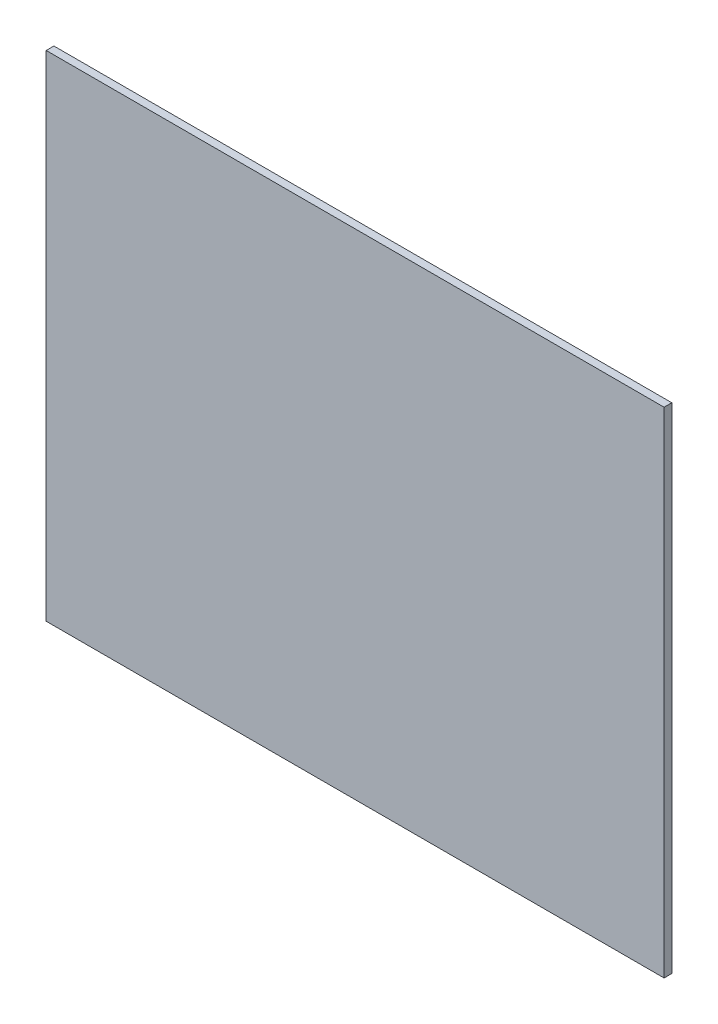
ISO-10303-21;
HEADER;
FILE_DESCRIPTION(('STEP AP214'),'2;1');
FILE_NAME('part.step','',(''),(''),'','','');
FILE_SCHEMA(('AUTOMOTIVE_DESIGN { 1 0 10303 214 1 1 1 1 }'));
ENDSEC;
DATA;
#1=APPLICATION_CONTEXT('core data for automotive mechanical design processes');
#2=APPLICATION_PROTOCOL_DEFINITION('international standard','automotive_design',2000,#1);
#3=PRODUCT_CONTEXT('',#1,'mechanical');
#4=PRODUCT('Part','Part','',(#3));
#5=PRODUCT_RELATED_PRODUCT_CATEGORY('part','',(#4));
#6=PRODUCT_DEFINITION_FORMATION('','',#4);
#7=PRODUCT_DEFINITION_CONTEXT('part definition',#1,'design');
#8=PRODUCT_DEFINITION('design','',#6,#7);
#9=PRODUCT_DEFINITION_SHAPE('','',#8);
#10=(LENGTH_UNIT() NAMED_UNIT(*) SI_UNIT(.MILLI.,.METRE.));
#11=(NAMED_UNIT(*) PLANE_ANGLE_UNIT() SI_UNIT($,.RADIAN.));
#12=(NAMED_UNIT(*) SI_UNIT($,.STERADIAN.) SOLID_ANGLE_UNIT());
#13=UNCERTAINTY_MEASURE_WITH_UNIT(LENGTH_MEASURE(1.E-05),#10,'distance_accuracy_value','');
#14=(GEOMETRIC_REPRESENTATION_CONTEXT(3) GLOBAL_UNCERTAINTY_ASSIGNED_CONTEXT((#13)) GLOBAL_UNIT_ASSIGNED_CONTEXT((#10,
#11,#12)) REPRESENTATION_CONTEXT('',''));
#15=CARTESIAN_POINT('',(0.,0.,0.));
#16=DIRECTION('',(0.,0.,1.));
#17=DIRECTION('',(1.,0.,0.));
#18=AXIS2_PLACEMENT_3D('',#15,#16,#17);
#19=CARTESIAN_POINT('',(-65.895816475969,388.540474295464,3.175));
#20=DIRECTION('',(0.,1.,0.));
#21=DIRECTION('',(0.,0.,1.));
#22=AXIS2_PLACEMENT_3D('',#19,#20,#21);
#23=PLANE('',#22);
#24=DIRECTION('',(1.,0.,0.));
#25=VECTOR('',#24,1.);
#26=CARTESIAN_POINT('',(-65.895816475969,388.540474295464,0.));
#27=LINE('',#26,#25);
#28=CARTESIAN_POINT('',(-65.895816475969,388.540474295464,0.));
#29=VERTEX_POINT('',#28);
#30=CARTESIAN_POINT('',(188.103167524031,388.540474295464,0.));
#31=VERTEX_POINT('',#30);
#32=EDGE_CURVE('E96',#29,#31,#27,.T.);
#33=ORIENTED_EDGE('',*,*,#32,.T.);
#34=DIRECTION('',(0.,0.,-1.));
#35=VECTOR('',#34,1.);
#36=CARTESIAN_POINT('',(188.103167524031,388.540474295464,3.175));
#37=LINE('',#36,#35);
#38=CARTESIAN_POINT('',(188.103167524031,388.540474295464,3.175));
#39=VERTEX_POINT('',#38);
#40=EDGE_CURVE('E11',#39,#31,#37,.T.);
#41=ORIENTED_EDGE('',*,*,#40,.F.);
#42=DIRECTION('',(1.,0.,0.));
#43=VECTOR('',#42,1.);
#44=CARTESIAN_POINT('',(-65.895816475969,388.540474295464,3.175));
#45=LINE('',#44,#43);
#46=CARTESIAN_POINT('',(-65.895816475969,388.540474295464,3.175));
#47=VERTEX_POINT('',#46);
#48=EDGE_CURVE('E82',#47,#39,#45,.T.);
#49=ORIENTED_EDGE('',*,*,#48,.F.);
#50=DIRECTION('',(0.,0.,-1.));
#51=VECTOR('',#50,1.);
#52=CARTESIAN_POINT('',(-65.895816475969,388.540474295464,3.175));
#53=LINE('',#52,#51);
#54=EDGE_CURVE('E49',#47,#29,#53,.T.);
#55=ORIENTED_EDGE('',*,*,#54,.T.);
#56=EDGE_LOOP('',(#33,#41,#49,#55));
#57=FACE_BOUND('',#56,.T.);
#58=ADVANCED_FACE('F33',(#57),#23,.F.);
#59=CARTESIAN_POINT('',(188.103167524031,388.540474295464,3.175));
#60=DIRECTION('',(-1.,0.,0.));
#61=DIRECTION('',(0.,0.,1.));
#62=AXIS2_PLACEMENT_3D('',#59,#60,#61);
#63=PLANE('',#62);
#64=DIRECTION('',(0.,1.,0.));
#65=VECTOR('',#64,1.);
#66=CARTESIAN_POINT('',(188.103167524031,388.540474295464,0.));
#67=LINE('',#66,#65);
#68=CARTESIAN_POINT('',(188.103167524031,591.740474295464,0.));
#69=VERTEX_POINT('',#68);
#70=EDGE_CURVE('E87',#31,#69,#67,.T.);
#71=ORIENTED_EDGE('',*,*,#70,.T.);
#72=DIRECTION('',(0.,0.,-1.));
#73=VECTOR('',#72,1.);
#74=CARTESIAN_POINT('',(188.103167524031,591.740474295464,3.175));
#75=LINE('',#74,#73);
#76=CARTESIAN_POINT('',(188.103167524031,591.740474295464,3.175));
#77=VERTEX_POINT('',#76);
#78=EDGE_CURVE('E41',#77,#69,#75,.T.);
#79=ORIENTED_EDGE('',*,*,#78,.F.);
#80=DIRECTION('',(0.,1.,0.));
#81=VECTOR('',#80,1.);
#82=CARTESIAN_POINT('',(188.103167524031,388.540474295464,3.175));
#83=LINE('',#82,#81);
#84=EDGE_CURVE('E74',#39,#77,#83,.T.);
#85=ORIENTED_EDGE('',*,*,#84,.F.);
#86=ORIENTED_EDGE('',*,*,#40,.T.);
#87=EDGE_LOOP('',(#71,#79,#85,#86));
#88=FACE_BOUND('',#87,.T.);
#89=ADVANCED_FACE('F86',(#88),#63,.F.);
#90=CARTESIAN_POINT('',(-65.895816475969,591.740474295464,3.175));
#91=DIRECTION('',(0.,1.,0.));
#92=DIRECTION('',(0.,0.,1.));
#93=AXIS2_PLACEMENT_3D('',#90,#91,#92);
#94=PLANE('',#93);
#95=DIRECTION('',(1.,0.,0.));
#96=VECTOR('',#95,1.);
#97=CARTESIAN_POINT('',(-65.895816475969,591.740474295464,0.));
#98=LINE('',#97,#96);
#99=CARTESIAN_POINT('',(-65.895816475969,591.740474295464,0.));
#100=VERTEX_POINT('',#99);
#101=EDGE_CURVE('E99',#100,#69,#98,.T.);
#102=ORIENTED_EDGE('',*,*,#101,.F.);
#103=DIRECTION('',(0.,0.,-1.));
#104=VECTOR('',#103,1.);
#105=CARTESIAN_POINT('',(-65.895816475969,591.740474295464,3.175));
#106=LINE('',#105,#104);
#107=CARTESIAN_POINT('',(-65.895816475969,591.740474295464,3.175));
#108=VERTEX_POINT('',#107);
#109=EDGE_CURVE('E63',#108,#100,#106,.T.);
#110=ORIENTED_EDGE('',*,*,#109,.F.);
#111=DIRECTION('',(1.,0.,0.));
#112=VECTOR('',#111,1.);
#113=CARTESIAN_POINT('',(-65.895816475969,591.740474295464,3.175));
#114=LINE('',#113,#112);
#115=EDGE_CURVE('E81',#108,#77,#114,.T.);
#116=ORIENTED_EDGE('',*,*,#115,.T.);
#117=ORIENTED_EDGE('',*,*,#78,.T.);
#118=EDGE_LOOP('',(#102,#110,#116,#117));
#119=FACE_BOUND('',#118,.T.);
#120=ADVANCED_FACE('F90',(#119),#94,.T.);
#121=CARTESIAN_POINT('',(-65.895816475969,388.540474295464,3.175));
#122=DIRECTION('',(-1.,0.,0.));
#123=DIRECTION('',(0.,0.,1.));
#124=AXIS2_PLACEMENT_3D('',#121,#122,#123);
#125=PLANE('',#124);
#126=DIRECTION('',(0.,1.,0.));
#127=VECTOR('',#126,1.);
#128=CARTESIAN_POINT('',(-65.895816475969,388.540474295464,0.));
#129=LINE('',#128,#127);
#130=EDGE_CURVE('E101',#29,#100,#129,.T.);
#131=ORIENTED_EDGE('',*,*,#130,.F.);
#132=ORIENTED_EDGE('',*,*,#54,.F.);
#133=DIRECTION('',(0.,1.,0.));
#134=VECTOR('',#133,1.);
#135=CARTESIAN_POINT('',(-65.895816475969,388.540474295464,3.175));
#136=LINE('',#135,#134);
#137=EDGE_CURVE('E91',#47,#108,#136,.T.);
#138=ORIENTED_EDGE('',*,*,#137,.T.);
#139=ORIENTED_EDGE('',*,*,#109,.T.);
#140=EDGE_LOOP('',(#131,#132,#138,#139));
#141=FACE_BOUND('',#140,.T.);
#142=ADVANCED_FACE('F107',(#141),#125,.T.);
#143=CARTESIAN_POINT('',(0.,0.,3.175));
#144=DIRECTION('',(0.,0.,1.));
#145=DIRECTION('',(1.,0.,0.));
#146=AXIS2_PLACEMENT_3D('',#143,#144,#145);
#147=PLANE('',#146);
#148=ORIENTED_EDGE('',*,*,#48,.T.);
#149=ORIENTED_EDGE('',*,*,#84,.T.);
#150=ORIENTED_EDGE('',*,*,#115,.F.);
#151=ORIENTED_EDGE('',*,*,#137,.F.);
#152=EDGE_LOOP('',(#148,#149,#150,#151));
#153=FACE_BOUND('',#152,.T.);
#154=ADVANCED_FACE('F78',(#153),#147,.T.);
#155=CARTESIAN_POINT('',(0.,0.,0.));
#156=DIRECTION('',(0.,0.,1.));
#157=DIRECTION('',(1.,0.,0.));
#158=AXIS2_PLACEMENT_3D('',#155,#156,#157);
#159=PLANE('',#158);
#160=ORIENTED_EDGE('',*,*,#32,.F.);
#161=ORIENTED_EDGE('',*,*,#130,.T.);
#162=ORIENTED_EDGE('',*,*,#101,.T.);
#163=ORIENTED_EDGE('',*,*,#70,.F.);
#164=EDGE_LOOP('',(#160,#161,#162,#163));
#165=FACE_BOUND('',#164,.T.);
#166=ADVANCED_FACE('F106',(#165),#159,.F.);
#167=CLOSED_SHELL('',(#58,#89,#120,#142,#154,#166));
#168=MANIFOLD_SOLID_BREP('B2',#167);
#169=ADVANCED_BREP_SHAPE_REPRESENTATION('',(#18,#168),#14);
#170=SHAPE_DEFINITION_REPRESENTATION(#9,#169);
ENDSEC;
END-ISO-10303-21;
